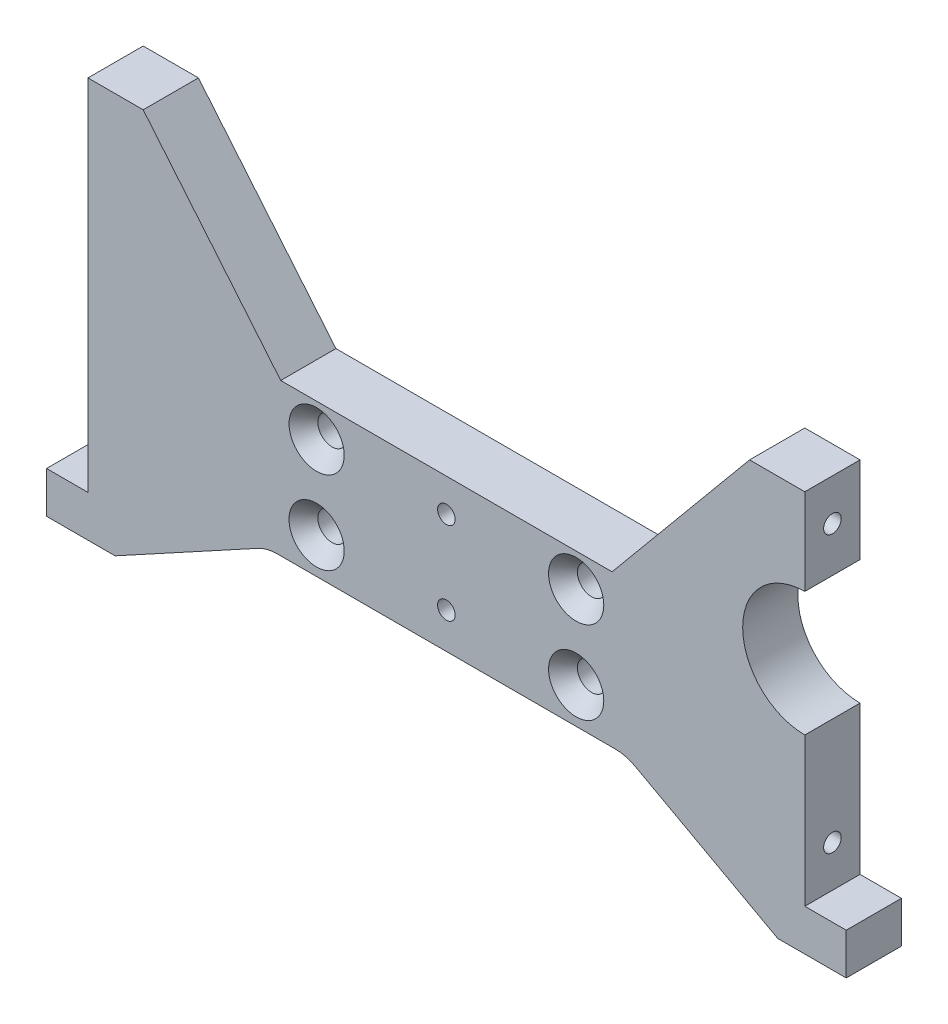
ISO-10303-21;
HEADER;
FILE_DESCRIPTION(('STEP AP214'),'2;1');
FILE_NAME('part.step','',(''),(''),'','','');
FILE_SCHEMA(('AUTOMOTIVE_DESIGN { 1 0 10303 214 1 1 1 1 }'));
ENDSEC;
DATA;
#1=APPLICATION_CONTEXT('core data for automotive mechanical design processes');
#2=APPLICATION_PROTOCOL_DEFINITION('international standard','automotive_design',2000,#1);
#3=PRODUCT_CONTEXT('',#1,'mechanical');
#4=PRODUCT('Part','Part','',(#3));
#5=PRODUCT_RELATED_PRODUCT_CATEGORY('part','',(#4));
#6=PRODUCT_DEFINITION_FORMATION('','',#4);
#7=PRODUCT_DEFINITION_CONTEXT('part definition',#1,'design');
#8=PRODUCT_DEFINITION('design','',#6,#7);
#9=PRODUCT_DEFINITION_SHAPE('','',#8);
#10=(LENGTH_UNIT() NAMED_UNIT(*) SI_UNIT(.MILLI.,.METRE.));
#11=(NAMED_UNIT(*) PLANE_ANGLE_UNIT() SI_UNIT($,.RADIAN.));
#12=(NAMED_UNIT(*) SI_UNIT($,.STERADIAN.) SOLID_ANGLE_UNIT());
#13=UNCERTAINTY_MEASURE_WITH_UNIT(LENGTH_MEASURE(1.E-05),#10,'distance_accuracy_value','');
#14=(GEOMETRIC_REPRESENTATION_CONTEXT(3) GLOBAL_UNCERTAINTY_ASSIGNED_CONTEXT((#13)) GLOBAL_UNIT_ASSIGNED_CONTEXT((#10,
#11,#12)) REPRESENTATION_CONTEXT('',''));
#15=CARTESIAN_POINT('',(0.,0.,0.));
#16=DIRECTION('',(0.,0.,1.));
#17=DIRECTION('',(1.,0.,0.));
#18=AXIS2_PLACEMENT_3D('',#15,#16,#17);
#19=CARTESIAN_POINT('',(-91.948,-9.52500000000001,-12.7));
#20=DIRECTION('',(0.,-1.,0.));
#21=DIRECTION('',(0.,0.,-1.));
#22=AXIS2_PLACEMENT_3D('',#19,#20,#21);
#23=PLANE('',#22);
#24=DIRECTION('',(0.,0.,-1.));
#25=VECTOR('',#24,1.);
#26=CARTESIAN_POINT('',(76.2,-9.52500000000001,0.));
#27=LINE('',#26,#25);
#28=CARTESIAN_POINT('',(76.2,-9.52500000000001,0.));
#29=VERTEX_POINT('',#28);
#30=CARTESIAN_POINT('',(76.2,-9.52500000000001,-12.7));
#31=VERTEX_POINT('',#30);
#32=EDGE_CURVE('E207',#29,#31,#27,.T.);
#33=ORIENTED_EDGE('',*,*,#32,.T.);
#34=DIRECTION('',(1.,0.,0.));
#35=VECTOR('',#34,1.);
#36=CARTESIAN_POINT('',(-91.948,-9.52500000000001,-12.7));
#37=LINE('',#36,#35);
#38=CARTESIAN_POINT('',(91.948,-9.52500000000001,-12.7));
#39=VERTEX_POINT('',#38);
#40=EDGE_CURVE('E342',#31,#39,#37,.T.);
#41=ORIENTED_EDGE('',*,*,#40,.T.);
#42=DIRECTION('',(0.,0.,1.));
#43=VECTOR('',#42,1.);
#44=CARTESIAN_POINT('',(91.948,-9.52500000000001,-12.7));
#45=LINE('',#44,#43);
#46=CARTESIAN_POINT('',(91.948,-9.52500000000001,0.));
#47=VERTEX_POINT('',#46);
#48=EDGE_CURVE('E217',#39,#47,#45,.T.);
#49=ORIENTED_EDGE('',*,*,#48,.T.);
#50=DIRECTION('',(1.,0.,0.));
#51=VECTOR('',#50,1.);
#52=CARTESIAN_POINT('',(-91.948,-9.52500000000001,0.));
#53=LINE('',#52,#51);
#54=EDGE_CURVE('E196',#29,#47,#53,.T.);
#55=ORIENTED_EDGE('',*,*,#54,.F.);
#56=EDGE_LOOP('',(#33,#41,#49,#55));
#57=FACE_BOUND('',#56,.T.);
#58=ADVANCED_FACE('F42',(#57),#23,.T.);
#59=CARTESIAN_POINT('',(82.423,82.55,-12.7));
#60=DIRECTION('',(0.,1.,0.));
#61=DIRECTION('',(0.,0.,1.));
#62=AXIS2_PLACEMENT_3D('',#59,#60,#61);
#63=PLANE('',#62);
#64=DIRECTION('',(0.,0.,1.));
#65=VECTOR('',#64,1.);
#66=CARTESIAN_POINT('',(69.723,82.55,-12.7));
#67=LINE('',#66,#65);
#68=CARTESIAN_POINT('',(69.723,82.55,-12.7));
#69=VERTEX_POINT('',#68);
#70=CARTESIAN_POINT('',(69.723,82.55,0.));
#71=VERTEX_POINT('',#70);
#72=EDGE_CURVE('E365',#69,#71,#67,.T.);
#73=ORIENTED_EDGE('',*,*,#72,.T.);
#74=DIRECTION('',(-1.,0.,0.));
#75=VECTOR('',#74,1.);
#76=CARTESIAN_POINT('',(82.423,82.55,0.));
#77=LINE('',#76,#75);
#78=CARTESIAN_POINT('',(82.423,82.55,0.));
#79=VERTEX_POINT('',#78);
#80=EDGE_CURVE('E243',#79,#71,#77,.T.);
#81=ORIENTED_EDGE('',*,*,#80,.F.);
#82=DIRECTION('',(0.,0.,1.));
#83=VECTOR('',#82,1.);
#84=CARTESIAN_POINT('',(82.423,82.55,-12.7));
#85=LINE('',#84,#83);
#86=CARTESIAN_POINT('',(82.423,82.55,-12.7));
#87=VERTEX_POINT('',#86);
#88=EDGE_CURVE('E256',#87,#79,#85,.T.);
#89=ORIENTED_EDGE('',*,*,#88,.F.);
#90=DIRECTION('',(-1.,0.,0.));
#91=VECTOR('',#90,1.);
#92=CARTESIAN_POINT('',(82.423,82.55,-12.7));
#93=LINE('',#92,#91);
#94=EDGE_CURVE('E362',#87,#69,#93,.T.);
#95=ORIENTED_EDGE('',*,*,#94,.T.);
#96=EDGE_LOOP('',(#73,#81,#89,#95));
#97=FACE_BOUND('',#96,.T.);
#98=ADVANCED_FACE('F302',(#97),#63,.T.);
#99=CARTESIAN_POINT('',(-82.423,0.,-12.7));
#100=DIRECTION('',(0.,1.,0.));
#101=DIRECTION('',(-1.,0.,0.));
#102=AXIS2_PLACEMENT_3D('',#99,#100,#101);
#103=PLANE('',#102);
#104=DIRECTION('',(-1.,0.,0.));
#105=VECTOR('',#104,1.);
#106=CARTESIAN_POINT('',(-82.423,0.,0.));
#107=LINE('',#106,#105);
#108=CARTESIAN_POINT('',(-82.423,0.,0.));
#109=VERTEX_POINT('',#108);
#110=CARTESIAN_POINT('',(-91.948,0.,0.));
#111=VERTEX_POINT('',#110);
#112=EDGE_CURVE('E225',#109,#111,#107,.T.);
#113=ORIENTED_EDGE('',*,*,#112,.F.);
#114=DIRECTION('',(0.,0.,1.));
#115=VECTOR('',#114,1.);
#116=CARTESIAN_POINT('',(-82.423,0.,-12.7));
#117=LINE('',#116,#115);
#118=CARTESIAN_POINT('',(-82.423,0.,-12.7));
#119=VERTEX_POINT('',#118);
#120=EDGE_CURVE('E250',#119,#109,#117,.T.);
#121=ORIENTED_EDGE('',*,*,#120,.F.);
#122=DIRECTION('',(-1.,0.,0.));
#123=VECTOR('',#122,1.);
#124=CARTESIAN_POINT('',(-82.423,0.,-12.7));
#125=LINE('',#124,#123);
#126=CARTESIAN_POINT('',(-91.948,0.,-12.7));
#127=VERTEX_POINT('',#126);
#128=EDGE_CURVE('E249',#119,#127,#125,.T.);
#129=ORIENTED_EDGE('',*,*,#128,.T.);
#130=DIRECTION('',(0.,0.,1.));
#131=VECTOR('',#130,1.);
#132=CARTESIAN_POINT('',(-91.948,0.,-12.7));
#133=LINE('',#132,#131);
#134=EDGE_CURVE('E269',#127,#111,#133,.T.);
#135=ORIENTED_EDGE('',*,*,#134,.T.);
#136=EDGE_LOOP('',(#113,#121,#129,#135));
#137=FACE_BOUND('',#136,.T.);
#138=ADVANCED_FACE('F308',(#137),#103,.T.);
#139=CARTESIAN_POINT('',(-82.423,19.8374,-12.7));
#140=DIRECTION('',(-1.,0.,0.));
#141=DIRECTION('',(0.,0.,1.));
#142=AXIS2_PLACEMENT_3D('',#139,#140,#141);
#143=PLANE('',#142);
#144=CARTESIAN_POINT('',(-82.423,9.525,-6.35));
#145=DIRECTION('',(-1.,0.,0.));
#146=DIRECTION('',(0.,0.,1.));
#147=AXIS2_PLACEMENT_3D('',#144,#145,#146);
#148=CIRCLE('',#147,2.01929999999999);
#149=CARTESIAN_POINT('',(-82.423,9.525,-4.33070000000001));
#150=VERTEX_POINT('',#149);
#151=EDGE_CURVE('E330',#150,#150,#148,.T.);
#152=ORIENTED_EDGE('',*,*,#151,.F.);
#153=EDGE_LOOP('',(#152));
#154=FACE_BOUND('',#153,.T.);
#155=CARTESIAN_POINT('',(-82.423,73.025,-6.35000000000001));
#156=DIRECTION('',(-1.,0.,0.));
#157=DIRECTION('',(0.,0.,1.));
#158=AXIS2_PLACEMENT_3D('',#155,#156,#157);
#159=CIRCLE('',#158,2.01929999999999);
#160=CARTESIAN_POINT('',(-82.423,73.025,-4.33070000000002));
#161=VERTEX_POINT('',#160);
#162=EDGE_CURVE('E472',#161,#161,#159,.T.);
#163=ORIENTED_EDGE('',*,*,#162,.F.);
#164=EDGE_LOOP('',(#163));
#165=FACE_BOUND('',#164,.T.);
#166=DIRECTION('',(0.,-1.,0.));
#167=VECTOR('',#166,1.);
#168=CARTESIAN_POINT('',(-82.423,19.8374,0.));
#169=LINE('',#168,#167);
#170=CARTESIAN_POINT('',(-82.423,82.55,0.));
#171=VERTEX_POINT('',#170);
#172=EDGE_CURVE('E246',#171,#109,#169,.T.);
#173=ORIENTED_EDGE('',*,*,#172,.F.);
#174=DIRECTION('',(0.,0.,1.));
#175=VECTOR('',#174,1.);
#176=CARTESIAN_POINT('',(-82.423,82.55,-12.7));
#177=LINE('',#176,#175);
#178=CARTESIAN_POINT('',(-82.423,82.55,-12.7));
#179=VERTEX_POINT('',#178);
#180=EDGE_CURVE('E253',#179,#171,#177,.T.);
#181=ORIENTED_EDGE('',*,*,#180,.F.);
#182=DIRECTION('',(0.,-1.,0.));
#183=VECTOR('',#182,1.);
#184=CARTESIAN_POINT('',(-82.423,82.55,-12.7));
#185=LINE('',#184,#183);
#186=EDGE_CURVE('E271',#179,#119,#185,.T.);
#187=ORIENTED_EDGE('',*,*,#186,.T.);
#188=ORIENTED_EDGE('',*,*,#120,.T.);
#189=EDGE_LOOP('',(#173,#181,#187,#188));
#190=FACE_BOUND('',#189,.T.);
#191=ADVANCED_FACE('F387',(#154,#165,#190),#143,.T.);
#192=DIRECTION('',(0.,0.,1.));
#193=VECTOR('',#192,1.);
#194=CARTESIAN_POINT('',(-69.723,82.55,-12.7));
#195=LINE('',#194,#193);
#196=CARTESIAN_POINT('',(-69.723,82.55,-12.7));
#197=VERTEX_POINT('',#196);
#198=CARTESIAN_POINT('',(-69.723,82.55,0.));
#199=VERTEX_POINT('',#198);
#200=EDGE_CURVE('E377',#197,#199,#195,.T.);
#201=ORIENTED_EDGE('',*,*,#200,.F.);
#202=EDGE_CURVE('E361',#197,#179,#93,.T.);
#203=ORIENTED_EDGE('',*,*,#202,.T.);
#204=ORIENTED_EDGE('',*,*,#180,.T.);
#205=EDGE_CURVE('E242',#199,#171,#77,.T.);
#206=ORIENTED_EDGE('',*,*,#205,.F.);
#207=EDGE_LOOP('',(#201,#203,#204,#206));
#208=FACE_BOUND('',#207,.T.);
#209=ADVANCED_FACE('F311',(#208),#63,.T.);
#210=CARTESIAN_POINT('',(82.423,82.55,-12.7));
#211=DIRECTION('',(1.,0.,0.));
#212=DIRECTION('',(0.,1.,0.));
#213=AXIS2_PLACEMENT_3D('',#210,#211,#212);
#214=PLANE('',#213);
#215=CARTESIAN_POINT('',(82.423,73.025,-6.34999999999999));
#216=DIRECTION('',(1.,0.,0.));
#217=DIRECTION('',(0.,0.,-1.));
#218=AXIS2_PLACEMENT_3D('',#215,#216,#217);
#219=CIRCLE('',#218,2.0193);
#220=CARTESIAN_POINT('',(82.423,73.025,-8.36929999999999));
#221=VERTEX_POINT('',#220);
#222=EDGE_CURVE('E466',#221,#221,#219,.T.);
#223=ORIENTED_EDGE('',*,*,#222,.F.);
#224=EDGE_LOOP('',(#223));
#225=FACE_BOUND('',#224,.T.);
#226=DIRECTION('',(0.,1.,0.));
#227=VECTOR('',#226,1.);
#228=CARTESIAN_POINT('',(82.423,82.55,0.));
#229=LINE('',#228,#227);
#230=CARTESIAN_POINT('',(82.423,62.6872,0.));
#231=VERTEX_POINT('',#230);
#232=EDGE_CURVE('E239',#231,#79,#229,.T.);
#233=ORIENTED_EDGE('',*,*,#232,.F.);
#234=DIRECTION('',(0.,0.,1.));
#235=VECTOR('',#234,1.);
#236=CARTESIAN_POINT('',(82.423,62.6872,-12.7));
#237=LINE('',#236,#235);
#238=CARTESIAN_POINT('',(82.423,62.6872,-12.7));
#239=VERTEX_POINT('',#238);
#240=EDGE_CURVE('E258',#239,#231,#237,.T.);
#241=ORIENTED_EDGE('',*,*,#240,.F.);
#242=DIRECTION('',(0.,1.,0.));
#243=VECTOR('',#242,1.);
#244=CARTESIAN_POINT('',(82.423,82.55,-12.7));
#245=LINE('',#244,#243);
#246=EDGE_CURVE('E358',#239,#87,#245,.T.);
#247=ORIENTED_EDGE('',*,*,#246,.T.);
#248=ORIENTED_EDGE('',*,*,#88,.T.);
#249=EDGE_LOOP('',(#233,#241,#247,#248));
#250=FACE_BOUND('',#249,.T.);
#251=ADVANCED_FACE('F581',(#225,#250),#214,.T.);
#252=CARTESIAN_POINT('',(82.423,48.3997,-12.7));
#253=DIRECTION('',(0.,0.,1.));
#254=DIRECTION('',(1.,0.,0.));
#255=AXIS2_PLACEMENT_3D('',#252,#253,#254);
#256=CYLINDRICAL_SURFACE('',#255,14.2875);
#257=CARTESIAN_POINT('',(82.423,48.3997,0.));
#258=DIRECTION('',(0.,0.,-1.));
#259=DIRECTION('',(1.,0.,0.));
#260=AXIS2_PLACEMENT_3D('',#257,#258,#259);
#261=CIRCLE('',#260,14.2875);
#262=CARTESIAN_POINT('',(82.423,34.1122,0.));
#263=VERTEX_POINT('',#262);
#264=EDGE_CURVE('E236',#263,#231,#261,.T.);
#265=ORIENTED_EDGE('',*,*,#264,.F.);
#266=DIRECTION('',(0.,0.,1.));
#267=VECTOR('',#266,1.);
#268=CARTESIAN_POINT('',(82.423,34.1122,-12.7));
#269=LINE('',#268,#267);
#270=CARTESIAN_POINT('',(82.423,34.1122,-12.7));
#271=VERTEX_POINT('',#270);
#272=EDGE_CURVE('E260',#271,#263,#269,.T.);
#273=ORIENTED_EDGE('',*,*,#272,.F.);
#274=CARTESIAN_POINT('',(82.423,48.3997,-12.7));
#275=DIRECTION('',(0.,0.,-1.));
#276=DIRECTION('',(1.,0.,0.));
#277=AXIS2_PLACEMENT_3D('',#274,#275,#276);
#278=CIRCLE('',#277,14.2875);
#279=EDGE_CURVE('E355',#271,#239,#278,.T.);
#280=ORIENTED_EDGE('',*,*,#279,.T.);
#281=ORIENTED_EDGE('',*,*,#240,.T.);
#282=EDGE_LOOP('',(#265,#273,#280,#281));
#283=FACE_BOUND('',#282,.T.);
#284=ADVANCED_FACE('F584',(#283),#256,.F.);
#285=CARTESIAN_POINT('',(82.423,34.1122,-12.7));
#286=DIRECTION('',(1.,0.,0.));
#287=DIRECTION('',(0.,1.,0.));
#288=AXIS2_PLACEMENT_3D('',#285,#286,#287);
#289=PLANE('',#288);
#290=CARTESIAN_POINT('',(82.4230000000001,9.52499999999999,-6.34999999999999));
#291=DIRECTION('',(1.,0.,0.));
#292=DIRECTION('',(0.,0.,-1.));
#293=AXIS2_PLACEMENT_3D('',#290,#291,#292);
#294=CIRCLE('',#293,2.0193);
#295=CARTESIAN_POINT('',(82.4230000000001,9.52499999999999,-8.36929999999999));
#296=VERTEX_POINT('',#295);
#297=EDGE_CURVE('E460',#296,#296,#294,.T.);
#298=ORIENTED_EDGE('',*,*,#297,.F.);
#299=EDGE_LOOP('',(#298));
#300=FACE_BOUND('',#299,.T.);
#301=DIRECTION('',(0.,1.,0.));
#302=VECTOR('',#301,1.);
#303=CARTESIAN_POINT('',(82.423,34.1122,0.));
#304=LINE('',#303,#302);
#305=CARTESIAN_POINT('',(82.423,0.,0.));
#306=VERTEX_POINT('',#305);
#307=EDGE_CURVE('E233',#306,#263,#304,.T.);
#308=ORIENTED_EDGE('',*,*,#307,.F.);
#309=DIRECTION('',(0.,0.,1.));
#310=VECTOR('',#309,1.);
#311=CARTESIAN_POINT('',(82.423,0.,-12.7));
#312=LINE('',#311,#310);
#313=CARTESIAN_POINT('',(82.423,0.,-12.7));
#314=VERTEX_POINT('',#313);
#315=EDGE_CURVE('E262',#314,#306,#312,.T.);
#316=ORIENTED_EDGE('',*,*,#315,.F.);
#317=DIRECTION('',(0.,1.,0.));
#318=VECTOR('',#317,1.);
#319=CARTESIAN_POINT('',(82.423,34.1122,-12.7));
#320=LINE('',#319,#318);
#321=EDGE_CURVE('E352',#314,#271,#320,.T.);
#322=ORIENTED_EDGE('',*,*,#321,.T.);
#323=ORIENTED_EDGE('',*,*,#272,.T.);
#324=EDGE_LOOP('',(#308,#316,#322,#323));
#325=FACE_BOUND('',#324,.T.);
#326=ADVANCED_FACE('F588',(#300,#325),#289,.T.);
#327=CARTESIAN_POINT('',(82.423,0.,-12.7));
#328=DIRECTION('',(0.,1.,0.));
#329=DIRECTION('',(-1.,0.,0.));
#330=AXIS2_PLACEMENT_3D('',#327,#328,#329);
#331=PLANE('',#330);
#332=DIRECTION('',(-1.,0.,0.));
#333=VECTOR('',#332,1.);
#334=CARTESIAN_POINT('',(82.423,0.,0.));
#335=LINE('',#334,#333);
#336=CARTESIAN_POINT('',(91.948,0.,0.));
#337=VERTEX_POINT('',#336);
#338=EDGE_CURVE('E230',#337,#306,#335,.T.);
#339=ORIENTED_EDGE('',*,*,#338,.F.);
#340=DIRECTION('',(0.,0.,1.));
#341=VECTOR('',#340,1.);
#342=CARTESIAN_POINT('',(91.948,0.,-12.7));
#343=LINE('',#342,#341);
#344=CARTESIAN_POINT('',(91.948,0.,-12.7));
#345=VERTEX_POINT('',#344);
#346=EDGE_CURVE('E264',#345,#337,#343,.T.);
#347=ORIENTED_EDGE('',*,*,#346,.F.);
#348=DIRECTION('',(-1.,0.,0.));
#349=VECTOR('',#348,1.);
#350=CARTESIAN_POINT('',(82.423,0.,-12.7));
#351=LINE('',#350,#349);
#352=EDGE_CURVE('E345',#345,#314,#351,.T.);
#353=ORIENTED_EDGE('',*,*,#352,.T.);
#354=ORIENTED_EDGE('',*,*,#315,.T.);
#355=EDGE_LOOP('',(#339,#347,#353,#354));
#356=FACE_BOUND('',#355,.T.);
#357=ADVANCED_FACE('F323',(#356),#331,.T.);
#358=CARTESIAN_POINT('',(91.948,-9.52500000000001,-12.7));
#359=DIRECTION('',(1.,0.,0.));
#360=DIRECTION('',(0.,1.,0.));
#361=AXIS2_PLACEMENT_3D('',#358,#359,#360);
#362=PLANE('',#361);
#363=DIRECTION('',(0.,1.,0.));
#364=VECTOR('',#363,1.);
#365=CARTESIAN_POINT('',(91.948,-9.52500000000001,0.));
#366=LINE('',#365,#364);
#367=EDGE_CURVE('E223',#47,#337,#366,.T.);
#368=ORIENTED_EDGE('',*,*,#367,.F.);
#369=ORIENTED_EDGE('',*,*,#48,.F.);
#370=DIRECTION('',(0.,1.,0.));
#371=VECTOR('',#370,1.);
#372=CARTESIAN_POINT('',(91.948,-9.52500000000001,-12.7));
#373=LINE('',#372,#371);
#374=EDGE_CURVE('E341',#39,#345,#373,.T.);
#375=ORIENTED_EDGE('',*,*,#374,.T.);
#376=ORIENTED_EDGE('',*,*,#346,.T.);
#377=EDGE_LOOP('',(#368,#369,#375,#376));
#378=FACE_BOUND('',#377,.T.);
#379=ADVANCED_FACE('F316',(#378),#362,.T.);
#380=DIRECTION('',(0.,0.,-1.));
#381=VECTOR('',#380,1.);
#382=CARTESIAN_POINT('',(-76.2,-9.52500000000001,0.));
#383=LINE('',#382,#381);
#384=CARTESIAN_POINT('',(-76.2,-9.52500000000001,0.));
#385=VERTEX_POINT('',#384);
#386=CARTESIAN_POINT('',(-76.2,-9.52500000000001,-12.7));
#387=VERTEX_POINT('',#386);
#388=EDGE_CURVE('E213',#385,#387,#383,.T.);
#389=ORIENTED_EDGE('',*,*,#388,.F.);
#390=CARTESIAN_POINT('',(-91.948,-9.52500000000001,0.));
#391=VERTEX_POINT('',#390);
#392=EDGE_CURVE('E219',#391,#385,#53,.T.);
#393=ORIENTED_EDGE('',*,*,#392,.F.);
#394=DIRECTION('',(0.,0.,1.));
#395=VECTOR('',#394,1.);
#396=CARTESIAN_POINT('',(-91.948,-9.52500000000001,-12.7));
#397=LINE('',#396,#395);
#398=CARTESIAN_POINT('',(-91.948,-9.52500000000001,-12.7));
#399=VERTEX_POINT('',#398);
#400=EDGE_CURVE('E267',#399,#391,#397,.T.);
#401=ORIENTED_EDGE('',*,*,#400,.F.);
#402=EDGE_CURVE('E329',#399,#387,#37,.T.);
#403=ORIENTED_EDGE('',*,*,#402,.T.);
#404=EDGE_LOOP('',(#389,#393,#401,#403));
#405=FACE_BOUND('',#404,.T.);
#406=ADVANCED_FACE('F304',(#405),#23,.T.);
#407=CARTESIAN_POINT('',(-91.948,-9.52500000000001,-12.7));
#408=DIRECTION('',(-1.,0.,0.));
#409=DIRECTION('',(0.,-1.,0.));
#410=AXIS2_PLACEMENT_3D('',#407,#408,#409);
#411=PLANE('',#410);
#412=DIRECTION('',(0.,-1.,0.));
#413=VECTOR('',#412,1.);
#414=CARTESIAN_POINT('',(-91.948,-9.52500000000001,0.));
#415=LINE('',#414,#413);
#416=EDGE_CURVE('E220',#111,#391,#415,.T.);
#417=ORIENTED_EDGE('',*,*,#416,.F.);
#418=ORIENTED_EDGE('',*,*,#134,.F.);
#419=DIRECTION('',(0.,-1.,0.));
#420=VECTOR('',#419,1.);
#421=CARTESIAN_POINT('',(-91.948,-9.52500000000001,-12.7));
#422=LINE('',#421,#420);
#423=EDGE_CURVE('E338',#127,#399,#422,.T.);
#424=ORIENTED_EDGE('',*,*,#423,.T.);
#425=ORIENTED_EDGE('',*,*,#400,.T.);
#426=EDGE_LOOP('',(#417,#418,#424,#425));
#427=FACE_BOUND('',#426,.T.);
#428=ADVANCED_FACE('F315',(#427),#411,.T.);
#429=CARTESIAN_POINT('',(82.423,48.3997,-12.7));
#430=DIRECTION('',(0.,0.,1.));
#431=DIRECTION('',(1.,0.,0.));
#432=AXIS2_PLACEMENT_3D('',#429,#430,#431);
#433=PLANE('',#432);
#434=CARTESIAN_POINT('',(0.,36.83,-12.7));
#435=DIRECTION('',(0.,0.,1.));
#436=DIRECTION('',(1.,0.,0.));
#437=AXIS2_PLACEMENT_3D('',#434,#435,#436);
#438=CIRCLE('',#437,2.0193);
#439=CARTESIAN_POINT('',(2.0193,36.83,-12.7));
#440=VERTEX_POINT('',#439);
#441=EDGE_CURVE('E451',#440,#440,#438,.T.);
#442=ORIENTED_EDGE('',*,*,#441,.T.);
#443=EDGE_LOOP('',(#442));
#444=FACE_BOUND('',#443,.T.);
#445=CARTESIAN_POINT('',(0.,17.78,-12.7));
#446=DIRECTION('',(0.,0.,1.));
#447=DIRECTION('',(1.,0.,0.));
#448=AXIS2_PLACEMENT_3D('',#445,#446,#447);
#449=CIRCLE('',#448,2.0193);
#450=CARTESIAN_POINT('',(2.0193,17.78,-12.7));
#451=VERTEX_POINT('',#450);
#452=EDGE_CURVE('E445',#451,#451,#449,.T.);
#453=ORIENTED_EDGE('',*,*,#452,.T.);
#454=EDGE_LOOP('',(#453));
#455=FACE_BOUND('',#454,.T.);
#456=CARTESIAN_POINT('',(-29.845,36.83,-12.7));
#457=DIRECTION('',(0.,0.,1.));
#458=DIRECTION('',(1.,0.,0.));
#459=AXIS2_PLACEMENT_3D('',#456,#457,#458);
#460=CIRCLE('',#459,3.26389999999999);
#461=CARTESIAN_POINT('',(-26.5811,36.83,-12.7));
#462=VERTEX_POINT('',#461);
#463=EDGE_CURVE('E436',#462,#462,#460,.T.);
#464=ORIENTED_EDGE('',*,*,#463,.T.);
#465=EDGE_LOOP('',(#464));
#466=FACE_BOUND('',#465,.T.);
#467=CARTESIAN_POINT('',(-29.845,17.78,-12.7));
#468=DIRECTION('',(0.,0.,1.));
#469=DIRECTION('',(1.,0.,0.));
#470=AXIS2_PLACEMENT_3D('',#467,#468,#469);
#471=CIRCLE('',#470,3.26389999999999);
#472=CARTESIAN_POINT('',(-26.5811,17.78,-12.7));
#473=VERTEX_POINT('',#472);
#474=EDGE_CURVE('E427',#473,#473,#471,.T.);
#475=ORIENTED_EDGE('',*,*,#474,.T.);
#476=EDGE_LOOP('',(#475));
#477=FACE_BOUND('',#476,.T.);
#478=CARTESIAN_POINT('',(29.845,17.78,-12.7));
#479=DIRECTION('',(0.,0.,1.));
#480=DIRECTION('',(1.,0.,0.));
#481=AXIS2_PLACEMENT_3D('',#478,#479,#480);
#482=CIRCLE('',#481,3.26389999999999);
#483=CARTESIAN_POINT('',(33.1089,17.78,-12.7));
#484=VERTEX_POINT('',#483);
#485=EDGE_CURVE('E418',#484,#484,#482,.T.);
#486=ORIENTED_EDGE('',*,*,#485,.T.);
#487=EDGE_LOOP('',(#486));
#488=FACE_BOUND('',#487,.T.);
#489=CARTESIAN_POINT('',(29.845,36.83,-12.7));
#490=DIRECTION('',(0.,0.,1.));
#491=DIRECTION('',(1.,0.,0.));
#492=AXIS2_PLACEMENT_3D('',#489,#490,#491);
#493=CIRCLE('',#492,3.26389999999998);
#494=CARTESIAN_POINT('',(33.1089,36.83,-12.7));
#495=VERTEX_POINT('',#494);
#496=EDGE_CURVE('E401',#495,#495,#493,.T.);
#497=ORIENTED_EDGE('',*,*,#496,.T.);
#498=EDGE_LOOP('',(#497));
#499=FACE_BOUND('',#498,.T.);
#500=ORIENTED_EDGE('',*,*,#40,.F.);
#501=DIRECTION('',(0.877895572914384,-0.478852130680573,0.));
#502=VECTOR('',#501,1.);
#503=CARTESIAN_POINT('',(41.275,9.52499999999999,-12.7));
#504=LINE('',#503,#502);
#505=CARTESIAN_POINT('',(43.4072485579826,8.3619553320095,-12.7));
#506=VERTEX_POINT('',#505);
#507=EDGE_CURVE('E210',#506,#31,#504,.T.);
#508=ORIENTED_EDGE('',*,*,#507,.F.);
#509=CARTESIAN_POINT('',(38.8461820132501,0.,-12.7));
#510=DIRECTION('',(0.,0.,1.));
#511=DIRECTION('',(1.,0.,0.));
#512=AXIS2_PLACEMENT_3D('',#509,#510,#511);
#513=CIRCLE('',#512,9.525);
#514=CARTESIAN_POINT('',(38.8461820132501,9.52499999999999,-12.7));
#515=VERTEX_POINT('',#514);
#516=EDGE_CURVE('E279',#506,#515,#513,.T.);
#517=ORIENTED_EDGE('',*,*,#516,.T.);
#518=DIRECTION('',(1.,0.,0.));
#519=VECTOR('',#518,1.);
#520=CARTESIAN_POINT('',(41.275,9.52499999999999,-12.7));
#521=LINE('',#520,#519);
#522=CARTESIAN_POINT('',(-38.8461820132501,9.525,-12.7));
#523=VERTEX_POINT('',#522);
#524=EDGE_CURVE('E204',#523,#515,#521,.T.);
#525=ORIENTED_EDGE('',*,*,#524,.F.);
#526=CARTESIAN_POINT('',(-38.8461820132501,0.,-12.7));
#527=DIRECTION('',(0.,0.,1.));
#528=DIRECTION('',(1.,0.,0.));
#529=AXIS2_PLACEMENT_3D('',#526,#527,#528);
#530=CIRCLE('',#529,9.525);
#531=CARTESIAN_POINT('',(-43.4072485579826,8.36195533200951,-12.7));
#532=VERTEX_POINT('',#531);
#533=EDGE_CURVE('E50',#523,#532,#530,.T.);
#534=ORIENTED_EDGE('',*,*,#533,.T.);
#535=DIRECTION('',(0.877895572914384,0.478852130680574,0.));
#536=VECTOR('',#535,1.);
#537=CARTESIAN_POINT('',(-41.275,9.525,-12.7));
#538=LINE('',#537,#536);
#539=EDGE_CURVE('E289',#387,#532,#538,.T.);
#540=ORIENTED_EDGE('',*,*,#539,.F.);
#541=ORIENTED_EDGE('',*,*,#402,.F.);
#542=ORIENTED_EDGE('',*,*,#423,.F.);
#543=ORIENTED_EDGE('',*,*,#128,.F.);
#544=ORIENTED_EDGE('',*,*,#186,.F.);
#545=ORIENTED_EDGE('',*,*,#202,.F.);
#546=DIRECTION('',(0.638669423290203,-0.769481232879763,0.));
#547=VECTOR('',#546,1.);
#548=CARTESIAN_POINT('',(-69.723,82.55,-12.7));
#549=LINE('',#548,#547);
#550=CARTESIAN_POINT('',(-38.1,44.45,-12.7));
#551=VERTEX_POINT('',#550);
#552=EDGE_CURVE('E397',#197,#551,#549,.T.);
#553=ORIENTED_EDGE('',*,*,#552,.T.);
#554=DIRECTION('',(1.,0.,0.));
#555=VECTOR('',#554,1.);
#556=CARTESIAN_POINT('',(-38.1,44.45,-12.7));
#557=LINE('',#556,#555);
#558=CARTESIAN_POINT('',(38.1,44.45,-12.7));
#559=VERTEX_POINT('',#558);
#560=EDGE_CURVE('E409',#551,#559,#557,.T.);
#561=ORIENTED_EDGE('',*,*,#560,.T.);
#562=DIRECTION('',(0.638669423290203,0.769481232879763,0.));
#563=VECTOR('',#562,1.);
#564=CARTESIAN_POINT('',(38.1,44.45,-12.7));
#565=LINE('',#564,#563);
#566=EDGE_CURVE('E378',#559,#69,#565,.T.);
#567=ORIENTED_EDGE('',*,*,#566,.T.);
#568=ORIENTED_EDGE('',*,*,#94,.F.);
#569=ORIENTED_EDGE('',*,*,#246,.F.);
#570=ORIENTED_EDGE('',*,*,#279,.F.);
#571=ORIENTED_EDGE('',*,*,#321,.F.);
#572=ORIENTED_EDGE('',*,*,#352,.F.);
#573=ORIENTED_EDGE('',*,*,#374,.F.);
#574=EDGE_LOOP('',(#500,#508,#517,#525,#534,#540,#541,#542,#543,#544,#545,#553,#561,#567,#568,
#569,#570,#571,#572,#573));
#575=FACE_BOUND('',#574,.T.);
#576=ADVANCED_FACE('F282',(#444,#455,#466,#477,#488,#499,#575),#433,.F.);
#577=CARTESIAN_POINT('',(82.423,48.3997,0.));
#578=DIRECTION('',(0.,0.,1.));
#579=DIRECTION('',(1.,0.,0.));
#580=AXIS2_PLACEMENT_3D('',#577,#578,#579);
#581=PLANE('',#580);
#582=DIRECTION('',(1.,0.,0.));
#583=VECTOR('',#582,1.);
#584=CARTESIAN_POINT('',(41.275,9.52499999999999,0.));
#585=LINE('',#584,#583);
#586=CARTESIAN_POINT('',(-38.8461820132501,9.525,0.));
#587=VERTEX_POINT('',#586);
#588=CARTESIAN_POINT('',(38.8461820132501,9.52499999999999,0.));
#589=VERTEX_POINT('',#588);
#590=EDGE_CURVE('E214',#587,#589,#585,.T.);
#591=ORIENTED_EDGE('',*,*,#590,.T.);
#592=CARTESIAN_POINT('',(38.8461820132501,0.,0.));
#593=DIRECTION('',(0.,0.,1.));
#594=DIRECTION('',(1.,0.,0.));
#595=AXIS2_PLACEMENT_3D('',#592,#593,#594);
#596=CIRCLE('',#595,9.525);
#597=CARTESIAN_POINT('',(43.4072485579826,8.3619553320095,0.));
#598=VERTEX_POINT('',#597);
#599=EDGE_CURVE('E199',#589,#598,#596,.F.);
#600=ORIENTED_EDGE('',*,*,#599,.T.);
#601=DIRECTION('',(0.877895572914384,-0.478852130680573,0.));
#602=VECTOR('',#601,1.);
#603=CARTESIAN_POINT('',(41.275,9.52499999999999,0.));
#604=LINE('',#603,#602);
#605=EDGE_CURVE('E189',#598,#29,#604,.T.);
#606=ORIENTED_EDGE('',*,*,#605,.T.);
#607=ORIENTED_EDGE('',*,*,#54,.T.);
#608=ORIENTED_EDGE('',*,*,#367,.T.);
#609=ORIENTED_EDGE('',*,*,#338,.T.);
#610=ORIENTED_EDGE('',*,*,#307,.T.);
#611=ORIENTED_EDGE('',*,*,#264,.T.);
#612=ORIENTED_EDGE('',*,*,#232,.T.);
#613=ORIENTED_EDGE('',*,*,#80,.T.);
#614=DIRECTION('',(0.638669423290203,0.769481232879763,0.));
#615=VECTOR('',#614,1.);
#616=CARTESIAN_POINT('',(38.1,44.45,0.));
#617=LINE('',#616,#615);
#618=CARTESIAN_POINT('',(38.1,44.45,0.));
#619=VERTEX_POINT('',#618);
#620=EDGE_CURVE('E373',#619,#71,#617,.T.);
#621=ORIENTED_EDGE('',*,*,#620,.F.);
#622=DIRECTION('',(1.,0.,0.));
#623=VECTOR('',#622,1.);
#624=CARTESIAN_POINT('',(-38.1,44.45,0.));
#625=LINE('',#624,#623);
#626=CARTESIAN_POINT('',(-38.1,44.45,0.));
#627=VERTEX_POINT('',#626);
#628=EDGE_CURVE('E400',#627,#619,#625,.T.);
#629=ORIENTED_EDGE('',*,*,#628,.F.);
#630=DIRECTION('',(0.638669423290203,-0.769481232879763,0.));
#631=VECTOR('',#630,1.);
#632=CARTESIAN_POINT('',(-69.723,82.55,0.));
#633=LINE('',#632,#631);
#634=EDGE_CURVE('E395',#199,#627,#633,.T.);
#635=ORIENTED_EDGE('',*,*,#634,.F.);
#636=ORIENTED_EDGE('',*,*,#205,.T.);
#637=ORIENTED_EDGE('',*,*,#172,.T.);
#638=ORIENTED_EDGE('',*,*,#112,.T.);
#639=ORIENTED_EDGE('',*,*,#416,.T.);
#640=ORIENTED_EDGE('',*,*,#392,.T.);
#641=DIRECTION('',(0.877895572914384,0.478852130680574,0.));
#642=VECTOR('',#641,1.);
#643=CARTESIAN_POINT('',(-41.275,9.525,0.));
#644=LINE('',#643,#642);
#645=CARTESIAN_POINT('',(-43.4072485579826,8.36195533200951,0.));
#646=VERTEX_POINT('',#645);
#647=EDGE_CURVE('E203',#385,#646,#644,.T.);
#648=ORIENTED_EDGE('',*,*,#647,.T.);
#649=CARTESIAN_POINT('',(-38.8461820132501,0.,0.));
#650=DIRECTION('',(0.,0.,1.));
#651=DIRECTION('',(1.,0.,0.));
#652=AXIS2_PLACEMENT_3D('',#649,#650,#651);
#653=CIRCLE('',#652,9.525);
#654=EDGE_CURVE('E11',#646,#587,#653,.F.);
#655=ORIENTED_EDGE('',*,*,#654,.T.);
#656=EDGE_LOOP('',(#591,#600,#606,#607,#608,#609,#610,#611,#612,#613,#621,#629,#635,#636,#637,
#638,#639,#640,#648,#655));
#657=FACE_BOUND('',#656,.T.);
#658=CARTESIAN_POINT('',(0.,36.83,0.));
#659=DIRECTION('',(0.,0.,1.));
#660=DIRECTION('',(1.,0.,0.));
#661=AXIS2_PLACEMENT_3D('',#658,#659,#660);
#662=CIRCLE('',#661,2.0193);
#663=CARTESIAN_POINT('',(2.0193,36.83,0.));
#664=VERTEX_POINT('',#663);
#665=EDGE_CURVE('E454',#664,#664,#662,.T.);
#666=ORIENTED_EDGE('',*,*,#665,.F.);
#667=EDGE_LOOP('',(#666));
#668=FACE_BOUND('',#667,.T.);
#669=CARTESIAN_POINT('',(0.,17.78,0.));
#670=DIRECTION('',(0.,0.,1.));
#671=DIRECTION('',(1.,0.,0.));
#672=AXIS2_PLACEMENT_3D('',#669,#670,#671);
#673=CIRCLE('',#672,2.0193);
#674=CARTESIAN_POINT('',(2.0193,17.78,0.));
#675=VERTEX_POINT('',#674);
#676=EDGE_CURVE('E448',#675,#675,#673,.T.);
#677=ORIENTED_EDGE('',*,*,#676,.F.);
#678=EDGE_LOOP('',(#677));
#679=FACE_BOUND('',#678,.T.);
#680=CARTESIAN_POINT('',(-29.845,36.83,0.));
#681=DIRECTION('',(0.,0.,1.));
#682=DIRECTION('',(1.,0.,0.));
#683=AXIS2_PLACEMENT_3D('',#680,#681,#682);
#684=CIRCLE('',#683,6.35);
#685=CARTESIAN_POINT('',(-23.495,36.83,0.));
#686=VERTEX_POINT('',#685);
#687=EDGE_CURVE('E442',#686,#686,#684,.T.);
#688=ORIENTED_EDGE('',*,*,#687,.F.);
#689=EDGE_LOOP('',(#688));
#690=FACE_BOUND('',#689,.T.);
#691=CARTESIAN_POINT('',(-29.845,17.78,0.));
#692=DIRECTION('',(0.,0.,1.));
#693=DIRECTION('',(1.,0.,0.));
#694=AXIS2_PLACEMENT_3D('',#691,#692,#693);
#695=CIRCLE('',#694,6.35);
#696=CARTESIAN_POINT('',(-23.495,17.78,0.));
#697=VERTEX_POINT('',#696);
#698=EDGE_CURVE('E433',#697,#697,#695,.T.);
#699=ORIENTED_EDGE('',*,*,#698,.F.);
#700=EDGE_LOOP('',(#699));
#701=FACE_BOUND('',#700,.T.);
#702=CARTESIAN_POINT('',(29.845,17.78,0.));
#703=DIRECTION('',(0.,0.,1.));
#704=DIRECTION('',(1.,0.,0.));
#705=AXIS2_PLACEMENT_3D('',#702,#703,#704);
#706=CIRCLE('',#705,6.35);
#707=CARTESIAN_POINT('',(36.195,17.78,0.));
#708=VERTEX_POINT('',#707);
#709=EDGE_CURVE('E424',#708,#708,#706,.T.);
#710=ORIENTED_EDGE('',*,*,#709,.F.);
#711=EDGE_LOOP('',(#710));
#712=FACE_BOUND('',#711,.T.);
#713=CARTESIAN_POINT('',(29.845,36.83,0.));
#714=DIRECTION('',(0.,0.,1.));
#715=DIRECTION('',(1.,0.,0.));
#716=AXIS2_PLACEMENT_3D('',#713,#714,#715);
#717=CIRCLE('',#716,6.35);
#718=CARTESIAN_POINT('',(36.195,36.83,0.));
#719=VERTEX_POINT('',#718);
#720=EDGE_CURVE('E415',#719,#719,#717,.T.);
#721=ORIENTED_EDGE('',*,*,#720,.F.);
#722=EDGE_LOOP('',(#721));
#723=FACE_BOUND('',#722,.T.);
#724=ADVANCED_FACE('F192',(#657,#668,#679,#690,#701,#712,#723),#581,.T.);
#725=CARTESIAN_POINT('',(38.1,44.45,-12.7));
#726=DIRECTION('',(0.769481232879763,-0.638669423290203,0.));
#727=DIRECTION('',(0.638669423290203,0.769481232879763,0.));
#728=AXIS2_PLACEMENT_3D('',#725,#726,#727);
#729=PLANE('',#728);
#730=ORIENTED_EDGE('',*,*,#620,.T.);
#731=ORIENTED_EDGE('',*,*,#72,.F.);
#732=ORIENTED_EDGE('',*,*,#566,.F.);
#733=DIRECTION('',(0.,0.,1.));
#734=VECTOR('',#733,1.);
#735=CARTESIAN_POINT('',(38.1,44.45,-12.7));
#736=LINE('',#735,#734);
#737=EDGE_CURVE('E367',#559,#619,#736,.T.);
#738=ORIENTED_EDGE('',*,*,#737,.T.);
#739=EDGE_LOOP('',(#730,#731,#732,#738));
#740=FACE_BOUND('',#739,.T.);
#741=ADVANCED_FACE('F565',(#740),#729,.F.);
#742=CARTESIAN_POINT('',(-38.1,44.45,-12.7));
#743=DIRECTION('',(0.,-1.,0.));
#744=DIRECTION('',(1.,0.,0.));
#745=AXIS2_PLACEMENT_3D('',#742,#743,#744);
#746=PLANE('',#745);
#747=ORIENTED_EDGE('',*,*,#628,.T.);
#748=ORIENTED_EDGE('',*,*,#737,.F.);
#749=ORIENTED_EDGE('',*,*,#560,.F.);
#750=DIRECTION('',(0.,0.,1.));
#751=VECTOR('',#750,1.);
#752=CARTESIAN_POINT('',(-38.1,44.45,-12.7));
#753=LINE('',#752,#751);
#754=EDGE_CURVE('E370',#551,#627,#753,.T.);
#755=ORIENTED_EDGE('',*,*,#754,.T.);
#756=EDGE_LOOP('',(#747,#748,#749,#755));
#757=FACE_BOUND('',#756,.T.);
#758=ADVANCED_FACE('F568',(#757),#746,.F.);
#759=CARTESIAN_POINT('',(-69.723,82.55,-12.7));
#760=DIRECTION('',(-0.769481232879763,-0.638669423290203,0.));
#761=DIRECTION('',(0.638669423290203,-0.769481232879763,0.));
#762=AXIS2_PLACEMENT_3D('',#759,#760,#761);
#763=PLANE('',#762);
#764=ORIENTED_EDGE('',*,*,#634,.T.);
#765=ORIENTED_EDGE('',*,*,#754,.F.);
#766=ORIENTED_EDGE('',*,*,#552,.F.);
#767=ORIENTED_EDGE('',*,*,#200,.T.);
#768=EDGE_LOOP('',(#764,#765,#766,#767));
#769=FACE_BOUND('',#768,.T.);
#770=ADVANCED_FACE('F394',(#769),#763,.F.);
#771=CARTESIAN_POINT('',(29.845,36.83,0.));
#772=DIRECTION('',(0.,0.,1.));
#773=DIRECTION('',(1.,0.,0.));
#774=AXIS2_PLACEMENT_3D('',#771,#772,#773);
#775=CYLINDRICAL_SURFACE('',#774,3.26389999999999);
#776=ORIENTED_EDGE('',*,*,#496,.F.);
#777=EDGE_LOOP('',(#776));
#778=FACE_BOUND('',#777,.T.);
#779=CARTESIAN_POINT('',(29.845,36.83,-3.55015194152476));
#780=DIRECTION('',(0.,0.,1.));
#781=DIRECTION('',(1.,0.,0.));
#782=AXIS2_PLACEMENT_3D('',#779,#780,#781);
#783=CIRCLE('',#782,3.2639);
#784=CARTESIAN_POINT('',(33.1089,36.83,-3.55015194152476));
#785=VERTEX_POINT('',#784);
#786=EDGE_CURVE('E404',#785,#785,#783,.T.);
#787=ORIENTED_EDGE('',*,*,#786,.T.);
#788=EDGE_LOOP('',(#787));
#789=FACE_BOUND('',#788,.T.);
#790=ADVANCED_FACE('F560',(#778,#789),#775,.F.);
#791=CARTESIAN_POINT('',(29.845,36.83,0.));
#792=DIRECTION('',(0.,0.,1.));
#793=DIRECTION('',(1.,0.,0.));
#794=AXIS2_PLACEMENT_3D('',#791,#792,#793);
#795=CONICAL_SURFACE('',#794,6.35,0.715584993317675);
#796=ORIENTED_EDGE('',*,*,#786,.F.);
#797=EDGE_LOOP('',(#796));
#798=FACE_BOUND('',#797,.T.);
#799=ORIENTED_EDGE('',*,*,#720,.T.);
#800=EDGE_LOOP('',(#799));
#801=FACE_BOUND('',#800,.T.);
#802=ADVANCED_FACE('F556',(#798,#801),#795,.F.);
#803=CARTESIAN_POINT('',(29.845,17.78,0.));
#804=DIRECTION('',(0.,0.,1.));
#805=DIRECTION('',(1.,0.,0.));
#806=AXIS2_PLACEMENT_3D('',#803,#804,#805);
#807=CYLINDRICAL_SURFACE('',#806,3.26389999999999);
#808=ORIENTED_EDGE('',*,*,#485,.F.);
#809=EDGE_LOOP('',(#808));
#810=FACE_BOUND('',#809,.T.);
#811=CARTESIAN_POINT('',(29.845,17.78,-3.55015194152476));
#812=DIRECTION('',(0.,0.,1.));
#813=DIRECTION('',(1.,0.,0.));
#814=AXIS2_PLACEMENT_3D('',#811,#812,#813);
#815=CIRCLE('',#814,3.2639);
#816=CARTESIAN_POINT('',(33.1089,17.78,-3.55015194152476));
#817=VERTEX_POINT('',#816);
#818=EDGE_CURVE('E421',#817,#817,#815,.T.);
#819=ORIENTED_EDGE('',*,*,#818,.T.);
#820=EDGE_LOOP('',(#819));
#821=FACE_BOUND('',#820,.T.);
#822=ADVANCED_FACE('F552',(#810,#821),#807,.F.);
#823=CARTESIAN_POINT('',(29.845,17.78,0.));
#824=DIRECTION('',(0.,0.,1.));
#825=DIRECTION('',(1.,0.,0.));
#826=AXIS2_PLACEMENT_3D('',#823,#824,#825);
#827=CONICAL_SURFACE('',#826,6.35,0.715584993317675);
#828=ORIENTED_EDGE('',*,*,#818,.F.);
#829=EDGE_LOOP('',(#828));
#830=FACE_BOUND('',#829,.T.);
#831=ORIENTED_EDGE('',*,*,#709,.T.);
#832=EDGE_LOOP('',(#831));
#833=FACE_BOUND('',#832,.T.);
#834=ADVANCED_FACE('F548',(#830,#833),#827,.F.);
#835=CARTESIAN_POINT('',(-29.845,17.78,0.));
#836=DIRECTION('',(0.,0.,1.));
#837=DIRECTION('',(1.,0.,0.));
#838=AXIS2_PLACEMENT_3D('',#835,#836,#837);
#839=CYLINDRICAL_SURFACE('',#838,3.26389999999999);
#840=ORIENTED_EDGE('',*,*,#474,.F.);
#841=EDGE_LOOP('',(#840));
#842=FACE_BOUND('',#841,.T.);
#843=CARTESIAN_POINT('',(-29.845,17.78,-3.55015194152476));
#844=DIRECTION('',(0.,0.,1.));
#845=DIRECTION('',(1.,0.,0.));
#846=AXIS2_PLACEMENT_3D('',#843,#844,#845);
#847=CIRCLE('',#846,3.2639);
#848=CARTESIAN_POINT('',(-26.5811,17.78,-3.55015194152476));
#849=VERTEX_POINT('',#848);
#850=EDGE_CURVE('E430',#849,#849,#847,.T.);
#851=ORIENTED_EDGE('',*,*,#850,.T.);
#852=EDGE_LOOP('',(#851));
#853=FACE_BOUND('',#852,.T.);
#854=ADVANCED_FACE('F544',(#842,#853),#839,.F.);
#855=CARTESIAN_POINT('',(-29.845,17.78,0.));
#856=DIRECTION('',(0.,0.,1.));
#857=DIRECTION('',(1.,0.,0.));
#858=AXIS2_PLACEMENT_3D('',#855,#856,#857);
#859=CONICAL_SURFACE('',#858,6.35,0.715584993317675);
#860=ORIENTED_EDGE('',*,*,#850,.F.);
#861=EDGE_LOOP('',(#860));
#862=FACE_BOUND('',#861,.T.);
#863=ORIENTED_EDGE('',*,*,#698,.T.);
#864=EDGE_LOOP('',(#863));
#865=FACE_BOUND('',#864,.T.);
#866=ADVANCED_FACE('F540',(#862,#865),#859,.F.);
#867=CARTESIAN_POINT('',(-29.845,36.83,0.));
#868=DIRECTION('',(0.,0.,1.));
#869=DIRECTION('',(1.,0.,0.));
#870=AXIS2_PLACEMENT_3D('',#867,#868,#869);
#871=CYLINDRICAL_SURFACE('',#870,3.26389999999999);
#872=ORIENTED_EDGE('',*,*,#463,.F.);
#873=EDGE_LOOP('',(#872));
#874=FACE_BOUND('',#873,.T.);
#875=CARTESIAN_POINT('',(-29.845,36.83,-3.55015194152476));
#876=DIRECTION('',(0.,0.,1.));
#877=DIRECTION('',(1.,0.,0.));
#878=AXIS2_PLACEMENT_3D('',#875,#876,#877);
#879=CIRCLE('',#878,3.2639);
#880=CARTESIAN_POINT('',(-26.5811,36.83,-3.55015194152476));
#881=VERTEX_POINT('',#880);
#882=EDGE_CURVE('E439',#881,#881,#879,.T.);
#883=ORIENTED_EDGE('',*,*,#882,.T.);
#884=EDGE_LOOP('',(#883));
#885=FACE_BOUND('',#884,.T.);
#886=ADVANCED_FACE('F536',(#874,#885),#871,.F.);
#887=CARTESIAN_POINT('',(-29.845,36.83,0.));
#888=DIRECTION('',(0.,0.,1.));
#889=DIRECTION('',(1.,0.,0.));
#890=AXIS2_PLACEMENT_3D('',#887,#888,#889);
#891=CONICAL_SURFACE('',#890,6.35,0.715584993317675);
#892=ORIENTED_EDGE('',*,*,#882,.F.);
#893=EDGE_LOOP('',(#892));
#894=FACE_BOUND('',#893,.T.);
#895=ORIENTED_EDGE('',*,*,#687,.T.);
#896=EDGE_LOOP('',(#895));
#897=FACE_BOUND('',#896,.T.);
#898=ADVANCED_FACE('F532',(#894,#897),#891,.F.);
#899=CARTESIAN_POINT('',(0.,17.78,0.));
#900=DIRECTION('',(0.,0.,1.));
#901=DIRECTION('',(1.,0.,0.));
#902=AXIS2_PLACEMENT_3D('',#899,#900,#901);
#903=CYLINDRICAL_SURFACE('',#902,2.0193);
#904=ORIENTED_EDGE('',*,*,#452,.F.);
#905=EDGE_LOOP('',(#904));
#906=FACE_BOUND('',#905,.T.);
#907=ORIENTED_EDGE('',*,*,#676,.T.);
#908=EDGE_LOOP('',(#907));
#909=FACE_BOUND('',#908,.T.);
#910=ADVANCED_FACE('F528',(#906,#909),#903,.F.);
#911=CARTESIAN_POINT('',(0.,36.83,0.));
#912=DIRECTION('',(0.,0.,1.));
#913=DIRECTION('',(1.,0.,0.));
#914=AXIS2_PLACEMENT_3D('',#911,#912,#913);
#915=CYLINDRICAL_SURFACE('',#914,2.0193);
#916=ORIENTED_EDGE('',*,*,#441,.F.);
#917=EDGE_LOOP('',(#916));
#918=FACE_BOUND('',#917,.T.);
#919=ORIENTED_EDGE('',*,*,#665,.T.);
#920=EDGE_LOOP('',(#919));
#921=FACE_BOUND('',#920,.T.);
#922=ADVANCED_FACE('F524',(#918,#921),#915,.F.);
#923=CARTESIAN_POINT('',(70.3834000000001,9.52499999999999,-6.34999999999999));
#924=DIRECTION('',(1.,0.,0.));
#925=DIRECTION('',(0.,0.,-1.));
#926=AXIS2_PLACEMENT_3D('',#923,#924,#925);
#927=CONICAL_SURFACE('',#926,2.0193,1.02974425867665);
#928=CARTESIAN_POINT('',(69.1700821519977,9.52499999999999,-6.34999999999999));
#929=VERTEX_POINT('',#928);
#930=VERTEX_LOOP('',#929);
#931=FACE_BOUND('',#930,.T.);
#932=CARTESIAN_POINT('',(70.3834000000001,9.52499999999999,-6.34999999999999));
#933=DIRECTION('',(1.,0.,0.));
#934=DIRECTION('',(0.,0.,-1.));
#935=AXIS2_PLACEMENT_3D('',#932,#933,#934);
#936=CIRCLE('',#935,2.0193);
#937=CARTESIAN_POINT('',(70.3834000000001,9.52499999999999,-8.36929999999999));
#938=VERTEX_POINT('',#937);
#939=EDGE_CURVE('E457',#938,#938,#936,.T.);
#940=ORIENTED_EDGE('',*,*,#939,.T.);
#941=EDGE_LOOP('',(#940));
#942=FACE_BOUND('',#941,.T.);
#943=ADVANCED_FACE('F520',(#931,#942),#927,.F.);
#944=CARTESIAN_POINT('',(82.4230000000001,9.52499999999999,-6.34999999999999));
#945=DIRECTION('',(1.,0.,0.));
#946=DIRECTION('',(0.,0.,-1.));
#947=AXIS2_PLACEMENT_3D('',#944,#945,#946);
#948=CYLINDRICAL_SURFACE('',#947,2.0193);
#949=ORIENTED_EDGE('',*,*,#939,.F.);
#950=EDGE_LOOP('',(#949));
#951=FACE_BOUND('',#950,.T.);
#952=ORIENTED_EDGE('',*,*,#297,.T.);
#953=EDGE_LOOP('',(#952));
#954=FACE_BOUND('',#953,.T.);
#955=ADVANCED_FACE('F516',(#951,#954),#948,.F.);
#956=CARTESIAN_POINT('',(70.3834,73.025,-6.34999999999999));
#957=DIRECTION('',(1.,0.,0.));
#958=DIRECTION('',(0.,0.,-1.));
#959=AXIS2_PLACEMENT_3D('',#956,#957,#958);
#960=CONICAL_SURFACE('',#959,2.0193,1.02974425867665);
#961=CARTESIAN_POINT('',(69.1700821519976,73.025,-6.34999999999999));
#962=VERTEX_POINT('',#961);
#963=VERTEX_LOOP('',#962);
#964=FACE_BOUND('',#963,.T.);
#965=CARTESIAN_POINT('',(70.3834,73.025,-6.34999999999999));
#966=DIRECTION('',(1.,0.,0.));
#967=DIRECTION('',(0.,0.,-1.));
#968=AXIS2_PLACEMENT_3D('',#965,#966,#967);
#969=CIRCLE('',#968,2.0193);
#970=CARTESIAN_POINT('',(70.3834,73.025,-8.36929999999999));
#971=VERTEX_POINT('',#970);
#972=EDGE_CURVE('E463',#971,#971,#969,.T.);
#973=ORIENTED_EDGE('',*,*,#972,.T.);
#974=EDGE_LOOP('',(#973));
#975=FACE_BOUND('',#974,.T.);
#976=ADVANCED_FACE('F512',(#964,#975),#960,.F.);
#977=CARTESIAN_POINT('',(82.423,73.025,-6.34999999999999));
#978=DIRECTION('',(1.,0.,0.));
#979=DIRECTION('',(0.,0.,-1.));
#980=AXIS2_PLACEMENT_3D('',#977,#978,#979);
#981=CYLINDRICAL_SURFACE('',#980,2.0193);
#982=ORIENTED_EDGE('',*,*,#972,.F.);
#983=EDGE_LOOP('',(#982));
#984=FACE_BOUND('',#983,.T.);
#985=ORIENTED_EDGE('',*,*,#222,.T.);
#986=EDGE_LOOP('',(#985));
#987=FACE_BOUND('',#986,.T.);
#988=ADVANCED_FACE('F504',(#984,#987),#981,.F.);
#989=CARTESIAN_POINT('',(-70.3834,73.025,-6.35000000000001));
#990=DIRECTION('',(-1.,0.,0.));
#991=DIRECTION('',(0.,0.,1.));
#992=AXIS2_PLACEMENT_3D('',#989,#990,#991);
#993=CONICAL_SURFACE('',#992,2.01929999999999,1.02974425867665);
#994=CARTESIAN_POINT('',(-69.1700821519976,73.025,-6.35000000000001));
#995=VERTEX_POINT('',#994);
#996=VERTEX_LOOP('',#995);
#997=FACE_BOUND('',#996,.T.);
#998=CARTESIAN_POINT('',(-70.3834,73.025,-6.35000000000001));
#999=DIRECTION('',(-1.,0.,0.));
#1000=DIRECTION('',(0.,0.,1.));
#1001=AXIS2_PLACEMENT_3D('',#998,#999,#1000);
#1002=CIRCLE('',#1001,2.01929999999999);
#1003=CARTESIAN_POINT('',(-70.3834,73.025,-4.33070000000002));
#1004=VERTEX_POINT('',#1003);
#1005=EDGE_CURVE('E469',#1004,#1004,#1002,.T.);
#1006=ORIENTED_EDGE('',*,*,#1005,.T.);
#1007=EDGE_LOOP('',(#1006));
#1008=FACE_BOUND('',#1007,.T.);
#1009=ADVANCED_FACE('F495',(#997,#1008),#993,.F.);
#1010=CARTESIAN_POINT('',(-82.423,73.025,-6.35000000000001));
#1011=DIRECTION('',(-1.,0.,0.));
#1012=DIRECTION('',(0.,0.,1.));
#1013=AXIS2_PLACEMENT_3D('',#1010,#1011,#1012);
#1014=CYLINDRICAL_SURFACE('',#1013,2.01929999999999);
#1015=ORIENTED_EDGE('',*,*,#1005,.F.);
#1016=EDGE_LOOP('',(#1015));
#1017=FACE_BOUND('',#1016,.T.);
#1018=ORIENTED_EDGE('',*,*,#162,.T.);
#1019=EDGE_LOOP('',(#1018));
#1020=FACE_BOUND('',#1019,.T.);
#1021=ADVANCED_FACE('F492',(#1017,#1020),#1014,.F.);
#1022=CARTESIAN_POINT('',(-70.3834,9.525,-6.35));
#1023=DIRECTION('',(-1.,0.,0.));
#1024=DIRECTION('',(0.,0.,1.));
#1025=AXIS2_PLACEMENT_3D('',#1022,#1023,#1024);
#1026=CONICAL_SURFACE('',#1025,2.01929999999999,1.02974425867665);
#1027=CARTESIAN_POINT('',(-69.1700821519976,9.525,-6.35));
#1028=VERTEX_POINT('',#1027);
#1029=VERTEX_LOOP('',#1028);
#1030=FACE_BOUND('',#1029,.T.);
#1031=CARTESIAN_POINT('',(-70.3834,9.525,-6.35));
#1032=DIRECTION('',(-1.,0.,0.));
#1033=DIRECTION('',(0.,0.,1.));
#1034=AXIS2_PLACEMENT_3D('',#1031,#1032,#1033);
#1035=CIRCLE('',#1034,2.01929999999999);
#1036=CARTESIAN_POINT('',(-70.3834,9.525,-4.33070000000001));
#1037=VERTEX_POINT('',#1036);
#1038=EDGE_CURVE('E475',#1037,#1037,#1035,.T.);
#1039=ORIENTED_EDGE('',*,*,#1038,.T.);
#1040=EDGE_LOOP('',(#1039));
#1041=FACE_BOUND('',#1040,.T.);
#1042=ADVANCED_FACE('F494',(#1030,#1041),#1026,.F.);
#1043=CARTESIAN_POINT('',(-82.423,9.525,-6.35));
#1044=DIRECTION('',(-1.,0.,0.));
#1045=DIRECTION('',(0.,0.,1.));
#1046=AXIS2_PLACEMENT_3D('',#1043,#1044,#1045);
#1047=CYLINDRICAL_SURFACE('',#1046,2.01929999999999);
#1048=ORIENTED_EDGE('',*,*,#1038,.F.);
#1049=EDGE_LOOP('',(#1048));
#1050=FACE_BOUND('',#1049,.T.);
#1051=ORIENTED_EDGE('',*,*,#151,.T.);
#1052=EDGE_LOOP('',(#1051));
#1053=FACE_BOUND('',#1052,.T.);
#1054=ADVANCED_FACE('F485',(#1050,#1053),#1047,.F.);
#1055=CARTESIAN_POINT('',(41.275,9.52499999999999,0.));
#1056=DIRECTION('',(0.478852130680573,0.877895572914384,0.));
#1057=DIRECTION('',(-0.877895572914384,0.478852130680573,0.));
#1058=AXIS2_PLACEMENT_3D('',#1055,#1056,#1057);
#1059=PLANE('',#1058);
#1060=ORIENTED_EDGE('',*,*,#605,.F.);
#1061=DIRECTION('',(0.,0.,-1.));
#1062=VECTOR('',#1061,1.);
#1063=CARTESIAN_POINT('',(43.4072485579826,8.3619553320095,-12.7));
#1064=LINE('',#1063,#1062);
#1065=EDGE_CURVE('E252',#598,#506,#1064,.T.);
#1066=ORIENTED_EDGE('',*,*,#1065,.T.);
#1067=ORIENTED_EDGE('',*,*,#507,.T.);
#1068=ORIENTED_EDGE('',*,*,#32,.F.);
#1069=EDGE_LOOP('',(#1060,#1066,#1067,#1068));
#1070=FACE_BOUND('',#1069,.T.);
#1071=ADVANCED_FACE('F208',(#1070),#1059,.F.);
#1072=CARTESIAN_POINT('',(41.275,9.52499999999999,0.));
#1073=DIRECTION('',(0.,1.,0.));
#1074=DIRECTION('',(-1.,0.,0.));
#1075=AXIS2_PLACEMENT_3D('',#1072,#1073,#1074);
#1076=PLANE('',#1075);
#1077=ORIENTED_EDGE('',*,*,#524,.T.);
#1078=DIRECTION('',(0.,0.,-1.));
#1079=VECTOR('',#1078,1.);
#1080=CARTESIAN_POINT('',(38.8461820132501,9.52499999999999,0.));
#1081=LINE('',#1080,#1079);
#1082=EDGE_CURVE('E276',#515,#589,#1081,.F.);
#1083=ORIENTED_EDGE('',*,*,#1082,.T.);
#1084=ORIENTED_EDGE('',*,*,#590,.F.);
#1085=DIRECTION('',(0.,0.,-1.));
#1086=VECTOR('',#1085,1.);
#1087=CARTESIAN_POINT('',(-38.8461820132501,9.525,-12.7));
#1088=LINE('',#1087,#1086);
#1089=EDGE_CURVE('E273',#587,#523,#1088,.T.);
#1090=ORIENTED_EDGE('',*,*,#1089,.T.);
#1091=EDGE_LOOP('',(#1077,#1083,#1084,#1090));
#1092=FACE_BOUND('',#1091,.T.);
#1093=ADVANCED_FACE('F286',(#1092),#1076,.F.);
#1094=CARTESIAN_POINT('',(-41.275,9.525,0.));
#1095=DIRECTION('',(-0.478852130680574,0.877895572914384,0.));
#1096=DIRECTION('',(-0.877895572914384,-0.478852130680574,0.));
#1097=AXIS2_PLACEMENT_3D('',#1094,#1095,#1096);
#1098=PLANE('',#1097);
#1099=ORIENTED_EDGE('',*,*,#539,.T.);
#1100=DIRECTION('',(0.,0.,-1.));
#1101=VECTOR('',#1100,1.);
#1102=CARTESIAN_POINT('',(-43.4072485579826,8.36195533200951,0.));
#1103=LINE('',#1102,#1101);
#1104=EDGE_CURVE('E57',#532,#646,#1103,.F.);
#1105=ORIENTED_EDGE('',*,*,#1104,.T.);
#1106=ORIENTED_EDGE('',*,*,#647,.F.);
#1107=ORIENTED_EDGE('',*,*,#388,.T.);
#1108=EDGE_LOOP('',(#1099,#1105,#1106,#1107));
#1109=FACE_BOUND('',#1108,.T.);
#1110=ADVANCED_FACE('F293',(#1109),#1098,.F.);
#1111=CARTESIAN_POINT('',(38.8461820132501,0.,0.));
#1112=DIRECTION('',(0.,0.,1.));
#1113=DIRECTION('',(1.,0.,0.));
#1114=AXIS2_PLACEMENT_3D('',#1111,#1112,#1113);
#1115=CYLINDRICAL_SURFACE('',#1114,9.525);
#1116=ORIENTED_EDGE('',*,*,#599,.F.);
#1117=ORIENTED_EDGE('',*,*,#1082,.F.);
#1118=ORIENTED_EDGE('',*,*,#516,.F.);
#1119=ORIENTED_EDGE('',*,*,#1065,.F.);
#1120=EDGE_LOOP('',(#1116,#1117,#1118,#1119));
#1121=FACE_BOUND('',#1120,.T.);
#1122=ADVANCED_FACE('F291',(#1121),#1115,.F.);
#1123=CARTESIAN_POINT('',(-38.8461820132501,0.,0.));
#1124=DIRECTION('',(0.,0.,1.));
#1125=DIRECTION('',(1.,0.,0.));
#1126=AXIS2_PLACEMENT_3D('',#1123,#1124,#1125);
#1127=CYLINDRICAL_SURFACE('',#1126,9.525);
#1128=ORIENTED_EDGE('',*,*,#654,.F.);
#1129=ORIENTED_EDGE('',*,*,#1104,.F.);
#1130=ORIENTED_EDGE('',*,*,#533,.F.);
#1131=ORIENTED_EDGE('',*,*,#1089,.F.);
#1132=EDGE_LOOP('',(#1128,#1129,#1130,#1131));
#1133=FACE_BOUND('',#1132,.T.);
#1134=ADVANCED_FACE('F44',(#1133),#1127,.F.);
#1135=CLOSED_SHELL('',(#58,#98,#138,#191,#209,#251,#284,#326,#357,#379,#406,#428,#576,#724,#741,
#758,#770,#790,#802,#822,#834,#854,#866,#886,#898,#910,#922,#943,#955,#976,#988,#1009,#1021,
#1042,#1054,#1071,#1093,#1110,#1122,#1134));
#1136=MANIFOLD_SOLID_BREP('B2',#1135);
#1137=ADVANCED_BREP_SHAPE_REPRESENTATION('',(#18,#1136),#14);
#1138=SHAPE_DEFINITION_REPRESENTATION(#9,#1137);
ENDSEC;
END-ISO-10303-21;
